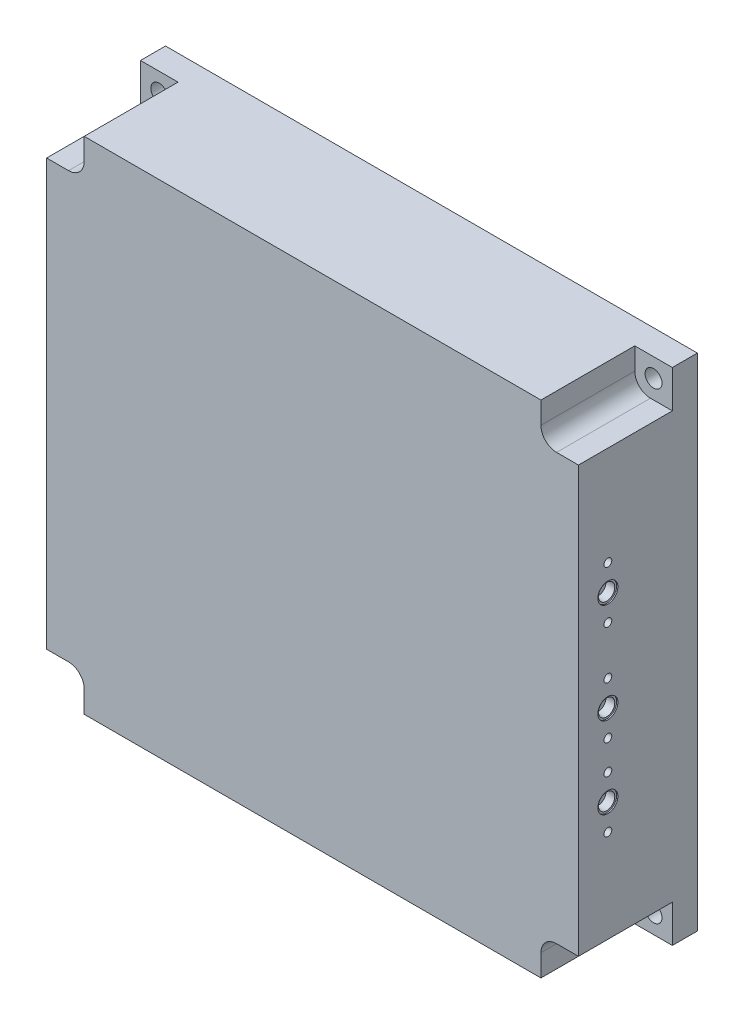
from build123d import *

# Parameters (mm, degrees)
SKETCH_2_W               = 85.000000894
SKETCH_2_H               = 79.999998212
EXTRUDE_1_DEPTH          = 19
CUT_EXTRUDE_1_DEPTH      = 15
SKETCH_4_R               = 1.35
CUT_EXTRUDE_2_DEPTH      = 244.820987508
CUT_EXTRUDE_3_DEPTH      = 1
CUT_EXTRUDE_4_DEPTH      = 15
HOLE_WIZARD_M1_6_1_D     = 1.25
HOLE_WIZARD_M1_6_1_DEPTH = 4
HOLE_WIZARD_M1_6_1_TIP   = 0.375537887
SKETCH_12_R              = 1.6
CUT_EXTRUDE_5_DEPTH      = 0.2
SKETCH_13_R              = 1.3
CUT_EXTRUDE_6_DEPTH      = 1.4
SKETCH_14_R              = 0.45
CUT_EXTRUDE_7_DEPTH      = 2
HOLE_WIZARD_M1_6_2_D     = 1.25
HOLE_WIZARD_M1_6_2_DEPTH = 4
HOLE_WIZARD_M1_6_2_TIP   = 0.375537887
CUT_EXTRUDE_START        = -0.2
SKETCH_18_R              = 1.6
CUT_EXTRUDE_8_DEPTH      = 0.2
CUT_EXTRUDE_START_2      = -1.4
SKETCH_19_R              = 1.3
CUT_EXTRUDE_9_DEPTH      = 1.4
CUT_EXTRUDE_START_3      = -2
SKETCH_20_R              = 0.45
CUT_EXTRUDE_10_DEPTH     = 2
HOLE_WIZARD_M1_6_3_D     = 1.25
HOLE_WIZARD_M1_6_3_DEPTH = 4
HOLE_WIZARD_M1_6_3_TIP   = 0.375537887
SKETCH_24_W              = 14.3
SKETCH_24_H              = 7
CUT_EXTRUDE_11_DEPTH     = 20
FILLET_1_R               = 2
HOLE_WIZARD_M2_1_D       = 1.6
HOLE_WIZARD_M2_1_DEPTH   = 6
HOLE_WIZARD_M2_1_TIP     = 0.480688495


with BuildPart() as part:
    # Sketch 2 → Extrude 1 (new body)
    with BuildSketch(Plane.XY):
        with Locations((142.570075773, 118.02765935)):
            Rectangle(SKETCH_2_W, SKETCH_2_H)
    extrude(amount=EXTRUDE_1_DEPTH)

    # Sketch 3 → Cut-Extrude 1 (cut)
    with BuildSketch(Plane.XY.offset(19)):
        with BuildLine():
            Line((179.070075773, 154.52765935), (179.070075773, 159.618927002))
            Line((179.070075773, 159.618927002), (187.867800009, 159.618927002))
            Line((187.867800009, 159.618927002), (187.867800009, 152.02765935))
            Line((187.867800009, 152.02765935), (181.570075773, 152.02765935))
            ThreePointArc((181.570075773, 152.02765935), (179.80230882, 152.759892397), (179.070075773, 154.52765935))
        make_face()
        with BuildLine():
            Line((106.070075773, 154.52765935), (106.070075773, 159.618925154))
            Line((106.070075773, 159.618925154), (98.136221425, 159.618925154))
            Line((98.136221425, 159.618925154), (98.136221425, 152.02765935))
            Line((98.136221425, 152.02765935), (103.570075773, 152.02765935))
            ThreePointArc((103.570075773, 152.02765935), (105.337842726, 152.759892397), (106.070075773, 154.52765935))
        make_face()
        with BuildLine():
            Line((106.070075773, 81.52765935), (106.070076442, 77.163571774))
            Line((106.070076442, 77.163571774), (99.051679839, 77.163571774))
            Line((99.051679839, 77.163571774), (99.051679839, 84.02765935))
            Line((99.051679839, 84.02765935), (103.570075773, 84.02765935))
            ThreePointArc((103.570075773, 84.02765935), (105.337842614, 83.295426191), (106.070075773, 81.52765935))
        make_face()
        with BuildLine():
            Line((181.570075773, 84.02765935), (186.004666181, 84.02765935))
            Line((186.004666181, 84.02765935), (186.004666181, 76.535194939))
            Line((186.004666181, 76.535194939), (179.070075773, 76.535194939))
            Line((179.070075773, 76.535194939), (179.070075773, 81.52765935))
            ThreePointArc((179.070075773, 81.52765935), (179.80230882, 83.295426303), (181.570075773, 84.02765935))
        make_face()
    extrude(amount=-CUT_EXTRUDE_1_DEPTH, mode=Mode.SUBTRACT)

    # Sketch 4 → Cut-Extrude 2 (cut, through all)
    with BuildSketch(Plane.XY.offset(4)):
        with Locations((103.070075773, 155.02765935)):
            Circle(SKETCH_4_R)
        with Locations((182.070075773, 155.02765935)):
            Circle(SKETCH_4_R)
        with Locations((182.070075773, 81.02765935)):
            Circle(SKETCH_4_R)
        with Locations((103.070075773, 81.02765935)):
            Circle(SKETCH_4_R)
    extrude(amount=-CUT_EXTRUDE_2_DEPTH, mode=Mode.SUBTRACT)

    # Sketch 6 → Cut-Extrude 3 (cut)
    with BuildSketch(Plane(origin=(0, 0, 0), x_dir=(-1, 0, 0), z_dir=(0, 0, -1))):
        with BuildLine():
            Line((-176.570075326, 157.027658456), (-108.570075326, 157.027658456))
            ThreePointArc((-108.570075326, 157.027658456), (-107.509415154, 156.588318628), (-107.070075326, 155.527658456))
            Line((-107.070075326, 155.527658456), (-107.070075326, 151.027658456))
            Line((-107.070075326, 151.027658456), (-102.570075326, 151.027658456))
            ThreePointArc((-102.570075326, 151.027658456), (-101.509415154, 150.588318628), (-101.070075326, 149.527658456))
            Line((-101.070075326, 149.527658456), (-101.070075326, 86.527658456))
            ThreePointArc((-101.070075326, 86.527658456), (-101.509415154, 85.466998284), (-102.570075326, 85.027658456))
            Line((-102.570075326, 85.027658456), (-107.070075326, 85.027658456))
            Line((-107.070075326, 85.027658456), (-107.070075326, 80.527658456))
            ThreePointArc((-107.070075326, 80.527658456), (-107.509415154, 79.466998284), (-108.570075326, 79.027658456))
            Line((-108.570075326, 79.027658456), (-176.570075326, 79.027658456))
            ThreePointArc((-176.570075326, 79.027658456), (-177.630735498, 79.466998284), (-178.070075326, 80.527658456))
            Line((-178.070075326, 80.527658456), (-178.070075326, 85.027658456))
            Line((-178.070075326, 85.027658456), (-182.570075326, 85.027658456))
            ThreePointArc((-182.570075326, 85.027658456), (-183.630735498, 85.466998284), (-184.070075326, 86.527658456))
            Line((-184.070075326, 86.527658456), (-184.070075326, 149.527658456))
            ThreePointArc((-184.070075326, 149.527658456), (-183.630735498, 150.588318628), (-182.570075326, 151.027658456))
            Line((-182.570075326, 151.027658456), (-178.070075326, 151.027658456))
            Line((-178.070075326, 151.027658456), (-178.070075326, 155.527658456))
            ThreePointArc((-178.070075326, 155.527658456), (-177.630735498, 156.588318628), (-176.570075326, 157.027658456))
        make_face()
    extrude(amount=-CUT_EXTRUDE_3_DEPTH, mode=Mode.SUBTRACT)

    # Sketch 7 → Cut-Extrude 4 (cut)
    with BuildSketch(Plane(origin=(0, 0, 1), x_dir=(-1, 0, 0), z_dir=(0, 0, -1))):
        with BuildLine():
            Line((-173.270075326, 154.027658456), (-111.870075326, 154.027658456))
            ThreePointArc((-111.870075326, 154.027658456), (-110.455861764, 153.441872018), (-109.870075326, 152.027658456))
            Line((-109.870075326, 152.027658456), (-109.870075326, 84.027658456))
            ThreePointArc((-109.870075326, 84.027658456), (-110.455861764, 82.613444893), (-111.870075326, 82.027658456))
            Line((-111.870075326, 82.027658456), (-173.270075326, 82.027658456))
            ThreePointArc((-173.270075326, 82.027658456), (-174.684288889, 82.613444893), (-175.270075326, 84.027658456))
            Line((-175.270075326, 84.027658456), (-175.270075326, 152.027658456))
            ThreePointArc((-175.270075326, 152.027658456), (-174.684288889, 153.441872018), (-173.270075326, 154.027658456))
        make_face()
    extrude(amount=-CUT_EXTRUDE_4_DEPTH, mode=Mode.SUBTRACT)

    # Hole Wizard M1.6 _1
    with Locations(Plane(origin=(182.370075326, 146.377658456, 1), x_dir=(-1, 0, 0), z_dir=(0, 0, -1))):
        with Locations((0, 0), (0, -5.25), (6.3, 8.95), (28.3, 8.95), (51.3, 8.95), (73.3, 8.95), (79.6, 0), (79.6, -5.25), (79.6, -20.65), (79.6, -36.05), (79.6, -51.45), (79.6, -56.7), (73.3, -65.65), (51.3, -65.65), (28.3, -65.65), (6.3, -65.65), (0, -56.7), (0, -51.45), (0, -36.05), (0, -20.65)):
            Hole(HOLE_WIZARD_M1_6_1_D / 2, depth=HOLE_WIZARD_M1_6_1_DEPTH)
            with Locations((0, 0, -(HOLE_WIZARD_M1_6_1_DEPTH + HOLE_WIZARD_M1_6_1_TIP / 2))):  # 118° drill point
                Cone(0, HOLE_WIZARD_M1_6_1_D / 2, HOLE_WIZARD_M1_6_1_TIP, mode=Mode.SUBTRACT)

    # Sketch 12 → Cut-Extrude 5 (cut)
    with BuildSketch(Plane(origin=(185.07007622, 0, 0), x_dir=(0, 0, -1), z_dir=(1, 0, 0))):
        with Locations((-14.299999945, 132.027659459)):
            Circle(SKETCH_12_R)
        with Locations((-14.300000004, 116.027659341)):
            Circle(SKETCH_12_R)
        with Locations((-14.299999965, 103.02765942)):
            Circle(SKETCH_12_R)
    extrude(amount=-CUT_EXTRUDE_5_DEPTH, mode=Mode.SUBTRACT)

    # Sketch 13 → Cut-Extrude 6 (cut)
    with BuildSketch(Plane(origin=(184.87007622, 0, 0), x_dir=(0, 0, -1), z_dir=(1, 0, 0))):
        with Locations((-14.299999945, 132.027659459)):
            Circle(SKETCH_13_R)
        with Locations((-14.300000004, 116.027659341)):
            Circle(SKETCH_13_R)
        with Locations((-14.299999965, 103.02765942)):
            Circle(SKETCH_13_R)
    extrude(amount=-CUT_EXTRUDE_6_DEPTH, mode=Mode.SUBTRACT)

    # Sketch 14 → Cut-Extrude 7 (cut)
    with BuildSketch(Plane(origin=(183.47007622, 0, 0), x_dir=(0, 0, -1), z_dir=(1, 0, 0))):
        with Locations((-14.299999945, 132.027659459)):
            Circle(SKETCH_14_R)
        with Locations((-14.300000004, 116.027659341)):
            Circle(SKETCH_14_R)
        with Locations((-14.299999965, 103.02765942)):
            Circle(SKETCH_14_R)
    extrude(amount=-CUT_EXTRUDE_7_DEPTH, mode=Mode.SUBTRACT)

    # Hole Wizard M1.6 _2
    with Locations(Plane(origin=(185.07007622, 120.17765935, 14.3), x_dir=(0, 0, 1), z_dir=(1, 0, 0))):
        with Locations((0, 0), (0, 8.3), (0, 13), (0, 21.3), (0, -7.7), (0, -16)):
            Hole(HOLE_WIZARD_M1_6_2_D / 2, depth=HOLE_WIZARD_M1_6_2_DEPTH)
            with Locations((0, 0, -(HOLE_WIZARD_M1_6_2_DEPTH + HOLE_WIZARD_M1_6_2_TIP / 2))):  # 118° drill point
                Cone(0, HOLE_WIZARD_M1_6_2_D / 2, HOLE_WIZARD_M1_6_2_TIP, mode=Mode.SUBTRACT)

    # Sketch 18 → Cut-Extrude 8 (cut)
    with BuildSketch(Plane.ZY.offset(-100.070075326).offset(CUT_EXTRUDE_START)):
        with Locations(Location((14.299999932, 132.027659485, 0), (0, 0, 180.000000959))):
            Circle(SKETCH_18_R)
        with Locations(Location((14.299999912, 103.027659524, 0), (0, 0, 180.000003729))):
            Circle(SKETCH_18_R)
    extrude(amount=CUT_EXTRUDE_8_DEPTH, mode=Mode.SUBTRACT)

    # Sketch 19 → Cut-Extrude 9 (cut)
    with BuildSketch(Plane.ZY.offset(-100.270075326).offset(CUT_EXTRUDE_START_2)):
        with Locations(Location((14.299999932, 132.027659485, 0), (0, 0, 180.00000118))):
            Circle(SKETCH_19_R)
        with Locations(Location((14.299999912, 103.027659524, 0), (0, 0, 180.000004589))):
            Circle(SKETCH_19_R)
    extrude(amount=CUT_EXTRUDE_9_DEPTH, mode=Mode.SUBTRACT)

    # Sketch 20 → Cut-Extrude 10 (cut)
    with BuildSketch(Plane.ZY.offset(-101.670075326).offset(CUT_EXTRUDE_START_3)):
        with Locations(Location((14.299999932, 132.027659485, 0), (0, 0, 180.000003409))):
            Circle(SKETCH_20_R)
        with Locations(Location((14.299999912, 103.027659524, 0), (0, 0, 180.000013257))):
            Circle(SKETCH_20_R)
    extrude(amount=CUT_EXTRUDE_10_DEPTH, mode=Mode.SUBTRACT)

    # Hole Wizard M1.6 _3
    with Locations(Plane(origin=(100.070075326, 107.17765935, 14.3), x_dir=(0, 0, -1), z_dir=(-1, 0, 0))):
        with Locations((0, 0), (0, 8.3), (0, -20.7), (0, -29)):
            Hole(HOLE_WIZARD_M1_6_3_D / 2, depth=HOLE_WIZARD_M1_6_3_DEPTH)
            with Locations((0, 0, -(HOLE_WIZARD_M1_6_3_DEPTH + HOLE_WIZARD_M1_6_3_TIP / 2))):  # 118° drill point
                Cone(0, HOLE_WIZARD_M1_6_3_D / 2, HOLE_WIZARD_M1_6_3_TIP, mode=Mode.SUBTRACT)

    # Sketch 24 → Cut-Extrude 11 (cut)
    with BuildSketch(Plane.XZ.offset(-78.027660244)):
        with Locations((165.320075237, 12.199999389)):
            Rectangle(SKETCH_24_W, SKETCH_24_H)
    extrude(amount=-CUT_EXTRUDE_11_DEPTH, mode=Mode.SUBTRACT)

    # Fillet 1
    fillet_1_edges = [part.edges().sort_by_distance(p)[0] for p in [
        (158.170075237, 80.02765935, 8.699999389),
        (158.170075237, 80.02765935, 15.699999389),
        (172.470075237, 80.02765935, 15.699999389),
        (172.470075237, 80.02765935, 8.699999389),
    ]]
    fillet(fillet_1_edges, radius=FILLET_1_R)

    # Hole Wizard M2 _1
    with Locations(Plane(origin=(156.31007504, 78.027660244, 12.199999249), x_dir=(0, 0, -1), z_dir=(0, -1, 0))):
        with Locations((0, 0), (-1.52e-07, 18.159995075)):
            Hole(HOLE_WIZARD_M2_1_D / 2, depth=HOLE_WIZARD_M2_1_DEPTH)
            with Locations((0, 0, -(HOLE_WIZARD_M2_1_DEPTH + HOLE_WIZARD_M2_1_TIP / 2))):  # 118° drill point
                Cone(0, HOLE_WIZARD_M2_1_D / 2, HOLE_WIZARD_M2_1_TIP, mode=Mode.SUBTRACT)


solid = part.part
